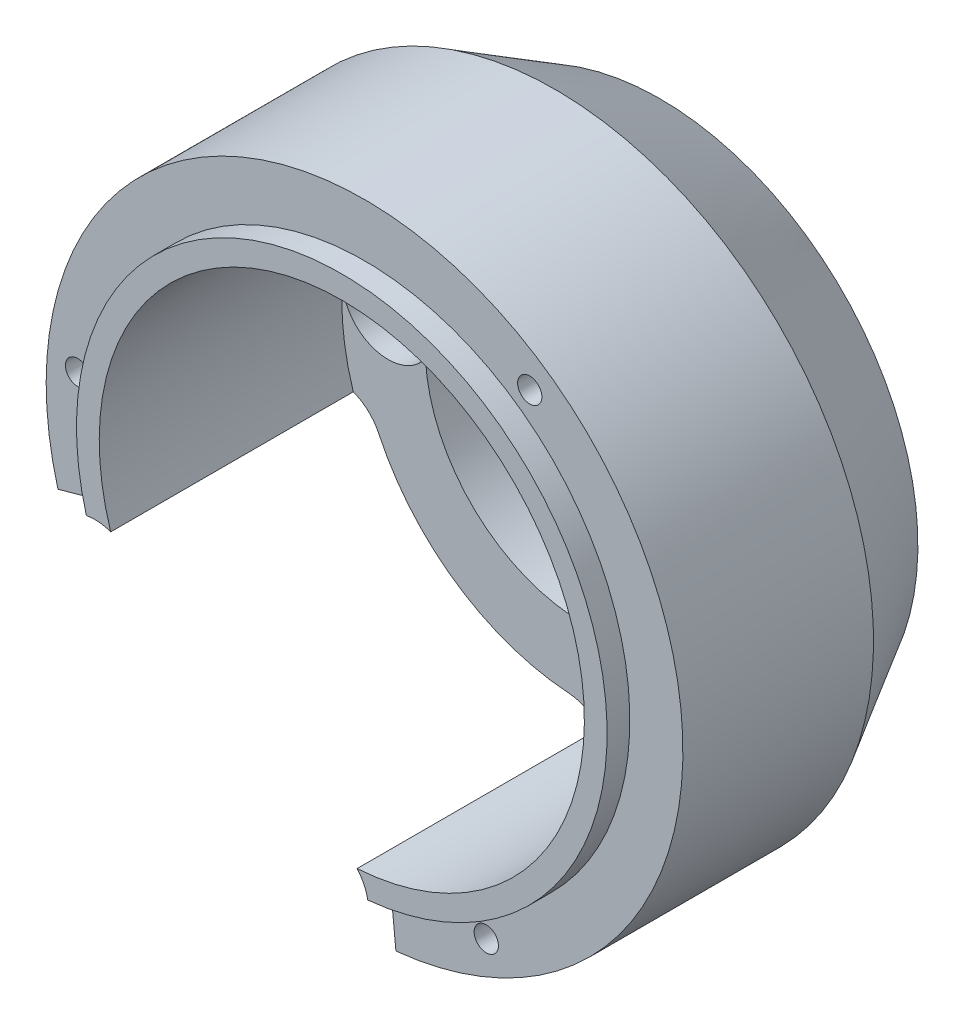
ISO-10303-21;
HEADER;
FILE_DESCRIPTION(('STEP AP214'),'2;1');
FILE_NAME('part.step','',(''),(''),'','','');
FILE_SCHEMA(('AUTOMOTIVE_DESIGN { 1 0 10303 214 1 1 1 1 }'));
ENDSEC;
DATA;
#1=APPLICATION_CONTEXT('core data for automotive mechanical design processes');
#2=APPLICATION_PROTOCOL_DEFINITION('international standard','automotive_design',2000,#1);
#3=PRODUCT_CONTEXT('',#1,'mechanical');
#4=PRODUCT('Part','Part','',(#3));
#5=PRODUCT_RELATED_PRODUCT_CATEGORY('part','',(#4));
#6=PRODUCT_DEFINITION_FORMATION('','',#4);
#7=PRODUCT_DEFINITION_CONTEXT('part definition',#1,'design');
#8=PRODUCT_DEFINITION('design','',#6,#7);
#9=PRODUCT_DEFINITION_SHAPE('','',#8);
#10=(LENGTH_UNIT() NAMED_UNIT(*) SI_UNIT(.MILLI.,.METRE.));
#11=(NAMED_UNIT(*) PLANE_ANGLE_UNIT() SI_UNIT($,.RADIAN.));
#12=(NAMED_UNIT(*) SI_UNIT($,.STERADIAN.) SOLID_ANGLE_UNIT());
#13=UNCERTAINTY_MEASURE_WITH_UNIT(LENGTH_MEASURE(1.E-05),#10,'distance_accuracy_value','');
#14=(GEOMETRIC_REPRESENTATION_CONTEXT(3) GLOBAL_UNCERTAINTY_ASSIGNED_CONTEXT((#13)) GLOBAL_UNIT_ASSIGNED_CONTEXT((#10,
#11,#12)) REPRESENTATION_CONTEXT('',''));
#15=CARTESIAN_POINT('',(0.,0.,0.));
#16=DIRECTION('',(0.,0.,1.));
#17=DIRECTION('',(1.,0.,0.));
#18=AXIS2_PLACEMENT_3D('',#15,#16,#17);
#19=CARTESIAN_POINT('',(85.81149290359,60.56189797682,86.5));
#20=DIRECTION('',(0.,0.,1.));
#21=DIRECTION('',(1.,0.,0.));
#22=AXIS2_PLACEMENT_3D('',#19,#20,#21);
#23=CYLINDRICAL_SURFACE('',#22,1.);
#24=CARTESIAN_POINT('',(85.81149290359,60.56189797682,82.5));
#25=DIRECTION('',(0.,0.,1.));
#26=DIRECTION('',(1.,0.,0.));
#27=AXIS2_PLACEMENT_3D('',#24,#25,#26);
#28=CIRCLE('',#27,1.);
#29=CARTESIAN_POINT('',(86.81149290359,60.56189797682,82.5));
#30=VERTEX_POINT('',#29);
#31=EDGE_CURVE('P0_E20',#30,#30,#28,.T.);
#32=ORIENTED_EDGE('',*,*,#31,.T.);
#33=EDGE_LOOP('',(#32));
#34=FACE_BOUND('',#33,.T.);
#35=CARTESIAN_POINT('',(85.81149290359,60.56189797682,86.5));
#36=DIRECTION('',(0.,0.,1.));
#37=DIRECTION('',(1.,0.,0.));
#38=AXIS2_PLACEMENT_3D('',#35,#36,#37);
#39=CIRCLE('',#38,1.);
#40=CARTESIAN_POINT('',(86.81149290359,60.56189797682,86.5));
#41=VERTEX_POINT('',#40);
#42=EDGE_CURVE('P0_E11',#41,#41,#39,.F.);
#43=ORIENTED_EDGE('',*,*,#42,.T.);
#44=EDGE_LOOP('',(#43));
#45=FACE_BOUND('',#44,.T.);
#46=ADVANCED_FACE('P0_F16',(#34,#45),#23,.T.);
#47=CARTESIAN_POINT('',(85.81149290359,60.56189797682,82.5));
#48=DIRECTION('',(0.,0.,1.));
#49=DIRECTION('',(1.,0.,0.));
#50=AXIS2_PLACEMENT_3D('',#47,#48,#49);
#51=PLANE('',#50);
#52=CARTESIAN_POINT('',(85.01149290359,60.56189797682,82.5));
#53=CARTESIAN_POINT('',(85.0116955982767,60.7147378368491,82.5));
#54=CARTESIAN_POINT('',(85.0676622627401,60.8563737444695,82.5));
#55=CARTESIAN_POINT('',(85.1283567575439,61.00997446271,82.5));
#56=CARTESIAN_POINT('',(85.2458074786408,61.1275834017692,82.5));
#57=CARTESIAN_POINT('',(85.3625135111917,61.244446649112,82.5));
#58=CARTESIAN_POINT('',(85.5170171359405,61.30572861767,82.5));
#59=CARTESIAN_POINT('',(85.6583749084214,61.3617964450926,82.5));
#60=CARTESIAN_POINT('',(85.81149290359,61.36189797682,82.5));
#61=CARTESIAN_POINT('',(85.9635646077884,61.3619988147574,82.5));
#62=CARTESIAN_POINT('',(86.1059686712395,61.30572861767,82.5));
#63=CARTESIAN_POINT('',(86.2595693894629,61.24503412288,82.5));
#64=CARTESIAN_POINT('',(86.3771783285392,61.1275834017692,82.5));
#65=CARTESIAN_POINT('',(86.4940415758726,61.0108773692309,82.5));
#66=CARTESIAN_POINT('',(86.55532354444,60.8563737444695,82.5));
#67=CARTESIAN_POINT('',(86.6112894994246,60.7152728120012,82.5));
#68=CARTESIAN_POINT('',(86.61149290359,60.56189797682,82.5));
#69=B_SPLINE_CURVE_WITH_KNOTS('',2,(#52,#53,#54,#55,#56,#57,#58,#59,#60,#61,#62,#63,#64,#65,#66,
#67,#68),.UNSPECIFIED.,.F.,.F.,(3,2,2,2,2,2,2,2,3),(0.,0.125,0.25,0.375,0.5,0.625,0.75,0.875,
1.),.UNSPECIFIED.);
#70=CARTESIAN_POINT('',(85.01149290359,60.56189797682,82.5));
#71=VERTEX_POINT('',#70);
#72=CARTESIAN_POINT('',(86.61149290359,60.56189797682,82.5));
#73=VERTEX_POINT('',#72);
#74=EDGE_CURVE('P0_E28',#71,#73,#69,.T.);
#75=ORIENTED_EDGE('',*,*,#74,.F.);
#76=CARTESIAN_POINT('',(86.61149290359,60.56189797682,82.5));
#77=CARTESIAN_POINT('',(86.6112902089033,60.4090581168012,82.5));
#78=CARTESIAN_POINT('',(86.55532354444,60.2674222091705,82.5));
#79=CARTESIAN_POINT('',(86.4946290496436,60.1138214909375,82.5));
#80=CARTESIAN_POINT('',(86.3771783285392,59.9962125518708,82.5));
#81=CARTESIAN_POINT('',(86.2604722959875,59.8793493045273,82.5));
#82=CARTESIAN_POINT('',(86.1059686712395,59.8180673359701,82.5));
#83=CARTESIAN_POINT('',(85.9646108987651,59.7619995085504,82.5));
#84=CARTESIAN_POINT('',(85.81149290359,59.76189797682,82.5));
#85=CARTESIAN_POINT('',(85.6594211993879,59.7617971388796,82.5));
#86=CARTESIAN_POINT('',(85.5170171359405,59.8180673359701,82.5));
#87=CARTESIAN_POINT('',(85.3634164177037,59.8787618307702,82.5));
#88=CARTESIAN_POINT('',(85.2458074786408,59.9962125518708,82.5));
#89=CARTESIAN_POINT('',(85.1289442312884,60.1129185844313,82.5));
#90=CARTESIAN_POINT('',(85.0676622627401,60.2674222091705,82.5));
#91=CARTESIAN_POINT('',(85.0116963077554,60.4085231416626,82.5));
#92=CARTESIAN_POINT('',(85.01149290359,60.56189797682,82.5));
#93=B_SPLINE_CURVE_WITH_KNOTS('',2,(#76,#77,#78,#79,#80,#81,#82,#83,#84,#85,#86,#87,#88,#89,#90,
#91,#92),.UNSPECIFIED.,.F.,.F.,(3,2,2,2,2,2,2,2,3),(0.,0.125,0.25,0.375,0.5,0.625,0.75,0.875,
1.),.UNSPECIFIED.);
#94=EDGE_CURVE('P0_E33',#73,#71,#93,.T.);
#95=ORIENTED_EDGE('',*,*,#94,.F.);
#96=EDGE_LOOP('',(#75,#95));
#97=FACE_BOUND('',#96,.T.);
#98=ORIENTED_EDGE('',*,*,#31,.F.);
#99=EDGE_LOOP('',(#98));
#100=FACE_BOUND('',#99,.T.);
#101=ADVANCED_FACE('P0_F17',(#97,#100),#51,.F.);
#102=OPEN_SHELL('',(#46,#101));
#103=SHELL_BASED_SURFACE_MODEL('P0_B1',(#102));
#104=CARTESIAN_POINT('',(64.83121485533,78.91477058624,70.));
#105=DIRECTION('',(0.,0.,-1.));
#106=DIRECTION('',(-1.,0.,0.));
#107=AXIS2_PLACEMENT_3D('',#104,#105,#106);
#108=PLANE('',#107);
#109=CARTESIAN_POINT('',(64.83121485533,78.91477058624,70.));
#110=DIRECTION('',(0.,0.,-1.));
#111=DIRECTION('',(-1.,0.,0.));
#112=AXIS2_PLACEMENT_3D('',#109,#110,#111);
#113=CIRCLE('',#112,1.6);
#114=CARTESIAN_POINT('',(63.23121485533,78.91477058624,70.));
#115=VERTEX_POINT('',#114);
#116=EDGE_CURVE('P1_E424',#115,#115,#113,.T.);
#117=ORIENTED_EDGE('',*,*,#116,.T.);
#118=EDGE_LOOP('',(#117));
#119=FACE_BOUND('',#118,.T.);
#120=CARTESIAN_POINT('',(77.78174593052,77.78174593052,70.));
#121=DIRECTION('',(0.,0.,1.));
#122=DIRECTION('',(1.,0.,0.));
#123=AXIS2_PLACEMENT_3D('',#120,#121,#122);
#124=CIRCLE('',#123,10.5);
#125=CARTESIAN_POINT('',(67.2975029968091,77.2067240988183,70.));
#126=VERTEX_POINT('',#125);
#127=CARTESIAN_POINT('',(67.5566336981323,80.1686015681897,70.));
#128=VERTEX_POINT('',#127);
#129=EDGE_CURVE('P1_E184',#126,#128,#124,.F.);
#130=ORIENTED_EDGE('',*,*,#129,.T.);
#131=CARTESIAN_POINT('',(64.83121485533,78.91477058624,70.));
#132=DIRECTION('',(0.,0.,-1.));
#133=DIRECTION('',(-1.,0.,0.));
#134=AXIS2_PLACEMENT_3D('',#131,#132,#133);
#135=CIRCLE('',#134,3.);
#136=EDGE_CURVE('P1_E171',#128,#126,#135,.F.);
#137=ORIENTED_EDGE('',*,*,#136,.T.);
#138=EDGE_LOOP('',(#130,#137));
#139=FACE_BOUND('',#138,.T.);
#140=ADVANCED_FACE('P1_F16',(#119,#139),#108,.F.);
#141=CARTESIAN_POINT('',(77.78174593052,77.78174593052,72.));
#142=DIRECTION('',(0.,0.,1.));
#143=DIRECTION('',(1.,0.,0.));
#144=AXIS2_PLACEMENT_3D('',#141,#142,#143);
#145=PLANE('',#144);
#146=CARTESIAN_POINT('',(77.78174593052,77.78174593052,72.));
#147=DIRECTION('',(0.,0.,1.));
#148=DIRECTION('',(1.,0.,0.));
#149=AXIS2_PLACEMENT_3D('',#146,#147,#148);
#150=CIRCLE('',#149,16.);
#151=CARTESIAN_POINT('',(86.9589689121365,90.8881786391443,72.));
#152=VERTEX_POINT('',#151);
#153=CARTESIAN_POINT('',(61.8426307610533,79.1762378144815,72.));
#154=VERTEX_POINT('',#153);
#155=EDGE_CURVE('P1_E440',#152,#154,#150,.T.);
#156=ORIENTED_EDGE('',*,*,#155,.T.);
#157=CARTESIAN_POINT('',(64.83121485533,78.91477058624,72.));
#158=DIRECTION('',(0.,0.,-1.));
#159=DIRECTION('',(-1.,0.,0.));
#160=AXIS2_PLACEMENT_3D('',#157,#158,#159);
#161=CIRCLE('',#160,3.);
#162=CARTESIAN_POINT('',(67.5566336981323,80.1686015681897,72.));
#163=VERTEX_POINT('',#162);
#164=EDGE_CURVE('P1_E156',#154,#163,#161,.T.);
#165=ORIENTED_EDGE('',*,*,#164,.T.);
#166=CARTESIAN_POINT('',(77.78174593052,77.78174593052,72.));
#167=DIRECTION('',(0.,0.,1.));
#168=DIRECTION('',(1.,0.,0.));
#169=AXIS2_PLACEMENT_3D('',#166,#167,#168);
#170=CIRCLE('',#169,10.5);
#171=CARTESIAN_POINT('',(82.5258838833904,87.1488775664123,72.));
#172=VERTEX_POINT('',#171);
#173=EDGE_CURVE('P1_E151',#163,#172,#170,.F.);
#174=ORIENTED_EDGE('',*,*,#173,.T.);
#175=CARTESIAN_POINT('',(85.23823960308,88.43072250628,72.));
#176=DIRECTION('',(0.,0.,-1.));
#177=DIRECTION('',(-1.,0.,0.));
#178=AXIS2_PLACEMENT_3D('',#175,#176,#177);
#179=CIRCLE('',#178,3.);
#180=EDGE_CURVE('P1_E19',#172,#152,#179,.T.);
#181=ORIENTED_EDGE('',*,*,#180,.T.);
#182=EDGE_LOOP('',(#156,#165,#174,#181));
#183=FACE_BOUND('',#182,.T.);
#184=ADVANCED_FACE('P1_F154',(#183),#145,.T.);
#185=CARTESIAN_POINT('',(85.23823960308,88.43072250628,72.));
#186=DIRECTION('',(0.,0.,-1.));
#187=DIRECTION('',(-1.,0.,0.));
#188=AXIS2_PLACEMENT_3D('',#185,#186,#187);
#189=CYLINDRICAL_SURFACE('',#188,3.);
#190=CARTESIAN_POINT('',(85.23823960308,88.43072250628,72.));
#191=DIRECTION('',(0.,0.,-1.));
#192=DIRECTION('',(-1.,0.,0.));
#193=AXIS2_PLACEMENT_3D('',#190,#191,#192);
#194=CIRCLE('',#193,3.);
#195=CARTESIAN_POINT('',(84.9613796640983,85.4435250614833,72.));
#196=VERTEX_POINT('',#195);
#197=EDGE_CURVE('P1_E169',#152,#196,#194,.T.);
#198=ORIENTED_EDGE('',*,*,#197,.F.);
#199=ORIENTED_EDGE('',*,*,#180,.F.);
#200=DIRECTION('',(0.,0.,1.));
#201=VECTOR('',#200,1.);
#202=CARTESIAN_POINT('',(82.525883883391,87.148877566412,65.95));
#203=LINE('',#202,#201);
#204=CARTESIAN_POINT('',(82.5258838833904,87.1488775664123,70.));
#205=VERTEX_POINT('',#204);
#206=EDGE_CURVE('P1_E161',#172,#205,#203,.F.);
#207=ORIENTED_EDGE('',*,*,#206,.T.);
#208=CARTESIAN_POINT('',(85.23823960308,88.43072250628,70.));
#209=DIRECTION('',(0.,0.,-1.));
#210=DIRECTION('',(-1.,0.,0.));
#211=AXIS2_PLACEMENT_3D('',#208,#209,#210);
#212=CIRCLE('',#211,3.);
#213=CARTESIAN_POINT('',(84.9613796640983,85.4435250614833,70.));
#214=VERTEX_POINT('',#213);
#215=EDGE_CURVE('P1_E411',#205,#214,#212,.T.);
#216=ORIENTED_EDGE('',*,*,#215,.T.);
#217=DIRECTION('',(0.,0.,1.));
#218=VECTOR('',#217,1.);
#219=CARTESIAN_POINT('',(84.9613796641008,85.4435250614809,65.95));
#220=LINE('',#219,#218);
#221=EDGE_CURVE('P1_E178',#214,#196,#220,.T.);
#222=ORIENTED_EDGE('',*,*,#221,.T.);
#223=EDGE_LOOP('',(#198,#199,#207,#216,#222));
#224=FACE_BOUND('',#223,.T.);
#225=ADVANCED_FACE('P1_F165',(#224),#189,.F.);
#226=CARTESIAN_POINT('',(64.83121485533,78.91477058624,72.));
#227=DIRECTION('',(0.,0.,-1.));
#228=DIRECTION('',(-1.,0.,0.));
#229=AXIS2_PLACEMENT_3D('',#226,#227,#228);
#230=CYLINDRICAL_SURFACE('',#229,3.);
#231=ORIENTED_EDGE('',*,*,#164,.F.);
#232=CARTESIAN_POINT('',(64.83121485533,78.91477058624,72.));
#233=DIRECTION('',(0.,0.,-1.));
#234=DIRECTION('',(-1.,0.,0.));
#235=AXIS2_PLACEMENT_3D('',#232,#233,#234);
#236=CIRCLE('',#235,3.);
#237=CARTESIAN_POINT('',(67.2975029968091,77.2067240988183,72.));
#238=VERTEX_POINT('',#237);
#239=EDGE_CURVE('P1_E449',#238,#154,#236,.T.);
#240=ORIENTED_EDGE('',*,*,#239,.F.);
#241=DIRECTION('',(0.,0.,1.));
#242=VECTOR('',#241,1.);
#243=CARTESIAN_POINT('',(67.297502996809,77.20672409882,65.95));
#244=LINE('',#243,#242);
#245=EDGE_CURVE('P1_E404',#238,#126,#244,.F.);
#246=ORIENTED_EDGE('',*,*,#245,.T.);
#247=ORIENTED_EDGE('',*,*,#136,.F.);
#248=DIRECTION('',(0.,0.,1.));
#249=VECTOR('',#248,1.);
#250=CARTESIAN_POINT('',(67.5566336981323,80.1686015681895,65.95));
#251=LINE('',#250,#249);
#252=EDGE_CURVE('P1_E162',#128,#163,#251,.T.);
#253=ORIENTED_EDGE('',*,*,#252,.T.);
#254=EDGE_LOOP('',(#231,#240,#246,#247,#253));
#255=FACE_BOUND('',#254,.T.);
#256=ADVANCED_FACE('P1_F332',(#255),#230,.F.);
#257=CARTESIAN_POINT('',(83.27578333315,65.99974469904,70.));
#258=DIRECTION('',(0.,0.,-1.));
#259=DIRECTION('',(-1.,0.,0.));
#260=AXIS2_PLACEMENT_3D('',#257,#258,#259);
#261=PLANE('',#260);
#262=CARTESIAN_POINT('',(83.27578333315,65.99974469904,70.));
#263=DIRECTION('',(0.,0.,-1.));
#264=DIRECTION('',(-1.,0.,0.));
#265=AXIS2_PLACEMENT_3D('',#262,#263,#264);
#266=CIRCLE('',#265,1.6);
#267=CARTESIAN_POINT('',(81.67578333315,65.99974469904,70.));
#268=VERTEX_POINT('',#267);
#269=EDGE_CURVE('P1_E427',#268,#268,#266,.T.);
#270=ORIENTED_EDGE('',*,*,#269,.T.);
#271=EDGE_LOOP('',(#270));
#272=FACE_BOUND('',#271,.T.);
#273=CARTESIAN_POINT('',(77.78174593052,77.78174593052,70.));
#274=DIRECTION('',(0.,0.,1.));
#275=DIRECTION('',(1.,0.,0.));
#276=AXIS2_PLACEMENT_3D('',#273,#274,#275);
#277=CIRCLE('',#276,10.5);
#278=CARTESIAN_POINT('',(83.5218509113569,68.9896361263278,70.));
#279=VERTEX_POINT('',#278);
#280=CARTESIAN_POINT('',(80.8272244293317,67.7331111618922,70.));
#281=VERTEX_POINT('',#280);
#282=EDGE_CURVE('P1_E403',#279,#281,#277,.F.);
#283=ORIENTED_EDGE('',*,*,#282,.T.);
#284=CARTESIAN_POINT('',(83.27578333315,65.99974469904,70.));
#285=DIRECTION('',(0.,0.,-1.));
#286=DIRECTION('',(-1.,0.,0.));
#287=AXIS2_PLACEMENT_3D('',#284,#285,#286);
#288=CIRCLE('',#287,3.);
#289=EDGE_CURVE('P1_E416',#281,#279,#288,.F.);
#290=ORIENTED_EDGE('',*,*,#289,.T.);
#291=EDGE_LOOP('',(#283,#290));
#292=FACE_BOUND('',#291,.T.);
#293=ADVANCED_FACE('P1_F328',(#272,#292),#261,.F.);
#294=CARTESIAN_POINT('',(77.78174593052,77.78174593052,72.));
#295=DIRECTION('',(0.,0.,1.));
#296=DIRECTION('',(1.,0.,0.));
#297=AXIS2_PLACEMENT_3D('',#294,#295,#296);
#298=PLANE('',#297);
#299=CARTESIAN_POINT('',(77.78174593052,77.78174593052,72.));
#300=DIRECTION('',(0.,0.,1.));
#301=DIRECTION('',(1.,0.,0.));
#302=AXIS2_PLACEMENT_3D('',#299,#300,#301);
#303=CIRCLE('',#302,10.5);
#304=CARTESIAN_POINT('',(83.5218509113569,68.9896361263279,72.));
#305=VERTEX_POINT('',#304);
#306=EDGE_CURVE('P1_E400',#196,#305,#303,.F.);
#307=ORIENTED_EDGE('',*,*,#306,.T.);
#308=CARTESIAN_POINT('',(83.27578333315,65.99974469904,72.));
#309=DIRECTION('',(0.,0.,-1.));
#310=DIRECTION('',(-1.,0.,0.));
#311=AXIS2_PLACEMENT_3D('',#308,#309,#310);
#312=CIRCLE('',#311,3.);
#313=CARTESIAN_POINT('',(84.5436381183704,63.2808213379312,72.));
#314=VERTEX_POINT('',#313);
#315=EDGE_CURVE('P1_E418',#305,#314,#312,.T.);
#316=ORIENTED_EDGE('',*,*,#315,.T.);
#317=CARTESIAN_POINT('',(77.78174593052,77.78174593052,72.));
#318=DIRECTION('',(0.,0.,1.));
#319=DIRECTION('',(1.,0.,0.));
#320=AXIS2_PLACEMENT_3D('',#317,#318,#319);
#321=CIRCLE('',#320,16.);
#322=EDGE_CURVE('P1_E414',#314,#152,#321,.T.);
#323=ORIENTED_EDGE('',*,*,#322,.T.);
#324=ORIENTED_EDGE('',*,*,#197,.T.);
#325=EDGE_LOOP('',(#307,#316,#323,#324));
#326=FACE_BOUND('',#325,.T.);
#327=ADVANCED_FACE('P1_F324',(#326),#298,.T.);
#328=CARTESIAN_POINT('',(83.27578333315,65.99974469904,72.));
#329=DIRECTION('',(0.,0.,-1.));
#330=DIRECTION('',(-1.,0.,0.));
#331=AXIS2_PLACEMENT_3D('',#328,#329,#330);
#332=CYLINDRICAL_SURFACE('',#331,3.);
#333=CARTESIAN_POINT('',(83.27578333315,65.99974469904,72.));
#334=DIRECTION('',(0.,0.,-1.));
#335=DIRECTION('',(-1.,0.,0.));
#336=AXIS2_PLACEMENT_3D('',#333,#334,#335);
#337=CIRCLE('',#336,3.);
#338=CARTESIAN_POINT('',(80.8272244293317,67.7331111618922,72.));
#339=VERTEX_POINT('',#338);
#340=EDGE_CURVE('P1_E446',#314,#339,#337,.T.);
#341=ORIENTED_EDGE('',*,*,#340,.F.);
#342=ORIENTED_EDGE('',*,*,#315,.F.);
#343=DIRECTION('',(0.,0.,1.));
#344=VECTOR('',#343,1.);
#345=CARTESIAN_POINT('',(83.52185091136,68.9896361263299,65.95));
#346=LINE('',#345,#344);
#347=EDGE_CURVE('P1_E397',#305,#279,#346,.F.);
#348=ORIENTED_EDGE('',*,*,#347,.T.);
#349=ORIENTED_EDGE('',*,*,#289,.F.);
#350=DIRECTION('',(0.,0.,1.));
#351=VECTOR('',#350,1.);
#352=CARTESIAN_POINT('',(80.8272244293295,67.7331111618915,65.95));
#353=LINE('',#352,#351);
#354=EDGE_CURVE('P1_E401',#281,#339,#353,.T.);
#355=ORIENTED_EDGE('',*,*,#354,.T.);
#356=EDGE_LOOP('',(#341,#342,#348,#349,#355));
#357=FACE_BOUND('',#356,.T.);
#358=ADVANCED_FACE('P1_F320',(#357),#332,.F.);
#359=CARTESIAN_POINT('',(85.23823960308,88.43072250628,70.));
#360=DIRECTION('',(0.,0.,-1.));
#361=DIRECTION('',(-1.,0.,0.));
#362=AXIS2_PLACEMENT_3D('',#359,#360,#361);
#363=PLANE('',#362);
#364=CARTESIAN_POINT('',(85.23823960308,88.43072250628,70.));
#365=DIRECTION('',(0.,0.,-1.));
#366=DIRECTION('',(-1.,0.,0.));
#367=AXIS2_PLACEMENT_3D('',#364,#365,#366);
#368=CIRCLE('',#367,1.6);
#369=CARTESIAN_POINT('',(83.63823960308,88.43072250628,70.));
#370=VERTEX_POINT('',#369);
#371=EDGE_CURVE('P1_E263',#370,#370,#368,.T.);
#372=ORIENTED_EDGE('',*,*,#371,.T.);
#373=EDGE_LOOP('',(#372));
#374=FACE_BOUND('',#373,.T.);
#375=CARTESIAN_POINT('',(77.78174593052,77.78174593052,70.));
#376=DIRECTION('',(0.,0.,1.));
#377=DIRECTION('',(1.,0.,0.));
#378=AXIS2_PLACEMENT_3D('',#375,#376,#377);
#379=CIRCLE('',#378,10.5);
#380=EDGE_CURVE('P1_E176',#205,#214,#379,.F.);
#381=ORIENTED_EDGE('',*,*,#380,.T.);
#382=ORIENTED_EDGE('',*,*,#215,.F.);
#383=EDGE_LOOP('',(#381,#382));
#384=FACE_BOUND('',#383,.T.);
#385=ADVANCED_FACE('P1_F316',(#374,#384),#363,.F.);
#386=CARTESIAN_POINT('',(77.78174593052,77.78174593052,88.));
#387=DIRECTION('',(0.,0.,1.));
#388=DIRECTION('',(1.,0.,0.));
#389=AXIS2_PLACEMENT_3D('',#386,#387,#388);
#390=PLANE('',#389);
#391=CARTESIAN_POINT('',(77.78174593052,77.78174593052,88.));
#392=DIRECTION('',(0.,0.,1.));
#393=DIRECTION('',(1.,0.,0.));
#394=AXIS2_PLACEMENT_3D('',#391,#392,#393);
#395=CIRCLE('',#394,17.5);
#396=CARTESIAN_POINT('',(60.9337304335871,73.0494765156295,88.));
#397=VERTEX_POINT('',#396);
#398=CARTESIAN_POINT('',(79.4960177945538,60.3659119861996,88.));
#399=VERTEX_POINT('',#398);
#400=EDGE_CURVE('P1_E375',#397,#399,#395,.F.);
#401=ORIENTED_EDGE('',*,*,#400,.F.);
#402=CARTESIAN_POINT('',(61.50146894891,70.1036874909,88.));
#403=DIRECTION('',(0.,0.,-1.));
#404=DIRECTION('',(-1.,0.,0.));
#405=AXIS2_PLACEMENT_3D('',#402,#403,#404);
#406=CIRCLE('',#405,3.);
#407=CARTESIAN_POINT('',(62.5386967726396,72.9186756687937,88.));
#408=VERTEX_POINT('',#407);
#409=EDGE_CURVE('P1_E396',#397,#408,#406,.T.);
#410=ORIENTED_EDGE('',*,*,#409,.T.);
#411=CARTESIAN_POINT('',(77.78174593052,77.78174593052,88.));
#412=DIRECTION('',(0.,0.,1.));
#413=DIRECTION('',(1.,0.,0.));
#414=AXIS2_PLACEMENT_3D('',#411,#412,#413);
#415=CIRCLE('',#414,16.);
#416=CARTESIAN_POINT('',(78.7908778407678,61.8136009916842,88.));
#417=VERTEX_POINT('',#416);
#418=EDGE_CURVE('P1_E435',#408,#417,#415,.F.);
#419=ORIENTED_EDGE('',*,*,#418,.T.);
#420=CARTESIAN_POINT('',(76.5453204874,59.82426135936,88.));
#421=DIRECTION('',(0.,0.,-1.));
#422=DIRECTION('',(-1.,0.,0.));
#423=AXIS2_PLACEMENT_3D('',#420,#421,#422);
#424=CIRCLE('',#423,3.);
#425=EDGE_CURVE('P1_E452',#417,#399,#424,.T.);
#426=ORIENTED_EDGE('',*,*,#425,.T.);
#427=EDGE_LOOP('',(#401,#410,#419,#426));
#428=FACE_BOUND('',#427,.T.);
#429=ADVANCED_FACE('P1_F312',(#428),#390,.T.);
#430=CARTESIAN_POINT('',(88.67969822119,93.34563477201,81.4999999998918));
#431=DIRECTION('',(0.,0.,1.));
#432=DIRECTION('',(1.,0.,0.));
#433=AXIS2_PLACEMENT_3D('',#430,#431,#432);
#434=CONICAL_SURFACE('',#433,0.799999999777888,1.04719755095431);
#435=CARTESIAN_POINT('',(88.67969822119,93.34563477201,81.5));
#436=DIRECTION('',(0.,0.,-1.));
#437=DIRECTION('',(-1.,0.,0.));
#438=AXIS2_PLACEMENT_3D('',#435,#436,#437);
#439=CIRCLE('',#438,0.8);
#440=CARTESIAN_POINT('',(87.87969822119,93.34563477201,81.5));
#441=VERTEX_POINT('',#440);
#442=EDGE_CURVE('P1_E390',#441,#441,#439,.F.);
#443=ORIENTED_EDGE('',*,*,#442,.T.);
#444=EDGE_LOOP('',(#443));
#445=FACE_BOUND('',#444,.T.);
#446=CARTESIAN_POINT('',(88.67969822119,93.34563477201,81.0381197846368));
#447=VERTEX_POINT('',#446);
#448=VERTEX_LOOP('',#447);
#449=FACE_BOUND('',#448,.T.);
#450=ADVANCED_FACE('P1_F308',(#445,#449),#434,.F.);
#451=CARTESIAN_POINT('',(58.85404666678,79.43770504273,81.5000000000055));
#452=DIRECTION('',(0.,0.,1.));
#453=DIRECTION('',(1.,0.,0.));
#454=AXIS2_PLACEMENT_3D('',#451,#452,#453);
#455=CONICAL_SURFACE('',#454,0.799999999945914,1.04719755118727);
#456=CARTESIAN_POINT('',(58.85404666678,79.43770504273,81.5));
#457=DIRECTION('',(0.,0.,-1.));
#458=DIRECTION('',(-1.,0.,0.));
#459=AXIS2_PLACEMENT_3D('',#456,#457,#458);
#460=CIRCLE('',#459,0.8);
#461=CARTESIAN_POINT('',(58.05404666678,79.43770504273,81.5));
#462=VERTEX_POINT('',#461);
#463=EDGE_CURVE('P1_E387',#462,#462,#460,.F.);
#464=ORIENTED_EDGE('',*,*,#463,.T.);
#465=EDGE_LOOP('',(#464));
#466=FACE_BOUND('',#465,.T.);
#467=CARTESIAN_POINT('',(58.8540466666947,79.4377050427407,81.0381197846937));
#468=VERTEX_POINT('',#467);
#469=VERTEX_LOOP('',#468);
#470=FACE_BOUND('',#469,.T.);
#471=ADVANCED_FACE('P1_F304',(#466,#470),#455,.F.);
#472=CARTESIAN_POINT('',(85.81149290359,60.56189797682,81.4999999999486));
#473=DIRECTION('',(0.,0.,1.));
#474=DIRECTION('',(1.,0.,0.));
#475=AXIS2_PLACEMENT_3D('',#472,#473,#474);
#476=CONICAL_SURFACE('',#475,0.800000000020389,1.04719755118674);
#477=CARTESIAN_POINT('',(85.81149290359,60.56189797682,81.5));
#478=DIRECTION('',(0.,0.,-1.));
#479=DIRECTION('',(-1.,0.,0.));
#480=AXIS2_PLACEMENT_3D('',#477,#478,#479);
#481=CIRCLE('',#480,0.8);
#482=CARTESIAN_POINT('',(85.01149290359,60.56189797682,81.5));
#483=VERTEX_POINT('',#482);
#484=EDGE_CURVE('P1_E380',#483,#483,#481,.F.);
#485=ORIENTED_EDGE('',*,*,#484,.T.);
#486=EDGE_LOOP('',(#485));
#487=FACE_BOUND('',#486,.T.);
#488=CARTESIAN_POINT('',(85.81149290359,60.56189797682,81.03811978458));
#489=VERTEX_POINT('',#488);
#490=VERTEX_LOOP('',#489);
#491=FACE_BOUND('',#490,.T.);
#492=ADVANCED_FACE('P1_F300',(#487,#491),#476,.F.);
#493=CARTESIAN_POINT('',(77.78174593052,77.78174593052,72.));
#494=DIRECTION('',(0.,0.,1.));
#495=DIRECTION('',(1.,0.,0.));
#496=AXIS2_PLACEMENT_3D('',#493,#494,#495);
#497=PLANE('',#496);
#498=CARTESIAN_POINT('',(77.78174593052,77.78174593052,72.));
#499=DIRECTION('',(0.,0.,1.));
#500=DIRECTION('',(1.,0.,0.));
#501=AXIS2_PLACEMENT_3D('',#498,#499,#500);
#502=CIRCLE('',#501,16.);
#503=CARTESIAN_POINT('',(78.7908778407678,61.8136009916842,72.));
#504=VERTEX_POINT('',#503);
#505=EDGE_CURVE('P1_E443',#504,#314,#502,.T.);
#506=ORIENTED_EDGE('',*,*,#505,.T.);
#507=ORIENTED_EDGE('',*,*,#340,.T.);
#508=CARTESIAN_POINT('',(77.78174593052,77.78174593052,72.));
#509=DIRECTION('',(0.,0.,1.));
#510=DIRECTION('',(1.,0.,0.));
#511=AXIS2_PLACEMENT_3D('',#508,#509,#510);
#512=CIRCLE('',#511,10.5);
#513=EDGE_CURVE('P1_E402',#339,#238,#512,.F.);
#514=ORIENTED_EDGE('',*,*,#513,.T.);
#515=ORIENTED_EDGE('',*,*,#239,.T.);
#516=CARTESIAN_POINT('',(77.78174593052,77.78174593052,72.));
#517=DIRECTION('',(0.,0.,1.));
#518=DIRECTION('',(1.,0.,0.));
#519=AXIS2_PLACEMENT_3D('',#516,#517,#518);
#520=CIRCLE('',#519,16.);
#521=CARTESIAN_POINT('',(62.5386967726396,72.9186756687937,72.));
#522=VERTEX_POINT('',#521);
#523=EDGE_CURVE('P1_E438',#154,#522,#520,.T.);
#524=ORIENTED_EDGE('',*,*,#523,.T.);
#525=CARTESIAN_POINT('',(61.50146894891,70.1036874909,72.));
#526=DIRECTION('',(0.,0.,-1.));
#527=DIRECTION('',(-1.,0.,0.));
#528=AXIS2_PLACEMENT_3D('',#525,#526,#527);
#529=CIRCLE('',#528,3.);
#530=CARTESIAN_POINT('',(64.2148484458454,71.3833638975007,72.));
#531=VERTEX_POINT('',#530);
#532=EDGE_CURVE('P1_E382',#522,#531,#529,.T.);
#533=ORIENTED_EDGE('',*,*,#532,.T.);
#534=CARTESIAN_POINT('',(77.78174593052,77.78174593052,72.));
#535=DIRECTION('',(0.,0.,-1.));
#536=DIRECTION('',(-1.,0.,0.));
#537=AXIS2_PLACEMENT_3D('',#534,#535,#536);
#538=CIRCLE('',#537,15.);
#539=CARTESIAN_POINT('',(76.7513913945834,62.8171754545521,72.));
#540=VERTEX_POINT('',#539);
#541=EDGE_CURVE('P1_E432',#540,#531,#538,.T.);
#542=ORIENTED_EDGE('',*,*,#541,.F.);
#543=CARTESIAN_POINT('',(76.5453204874,59.82426135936,72.));
#544=DIRECTION('',(0.,0.,-1.));
#545=DIRECTION('',(-1.,0.,0.));
#546=AXIS2_PLACEMENT_3D('',#543,#544,#545);
#547=CIRCLE('',#546,3.);
#548=EDGE_CURVE('P1_E238',#540,#504,#547,.T.);
#549=ORIENTED_EDGE('',*,*,#548,.T.);
#550=EDGE_LOOP('',(#506,#507,#514,#515,#524,#533,#542,#549));
#551=FACE_BOUND('',#550,.T.);
#552=ADVANCED_FACE('P1_F296',(#551),#497,.T.);
#553=CARTESIAN_POINT('',(77.78174593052,77.78174593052,65.95));
#554=DIRECTION('',(0.,0.,1.));
#555=DIRECTION('',(1.,0.,0.));
#556=AXIS2_PLACEMENT_3D('',#553,#554,#555);
#557=CYLINDRICAL_SURFACE('',#556,16.);
#558=ORIENTED_EDGE('',*,*,#418,.F.);
#559=DIRECTION('',(0.,0.,-1.));
#560=VECTOR('',#559,1.);
#561=CARTESIAN_POINT('',(62.5386967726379,72.9186756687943,0.));
#562=LINE('',#561,#560);
#563=EDGE_CURVE('P1_E393',#408,#522,#562,.T.);
#564=ORIENTED_EDGE('',*,*,#563,.T.);
#565=ORIENTED_EDGE('',*,*,#523,.F.);
#566=ORIENTED_EDGE('',*,*,#155,.F.);
#567=ORIENTED_EDGE('',*,*,#322,.F.);
#568=ORIENTED_EDGE('',*,*,#505,.F.);
#569=DIRECTION('',(0.,0.,-1.));
#570=VECTOR('',#569,1.);
#571=CARTESIAN_POINT('',(78.7908778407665,61.8136009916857,0.));
#572=LINE('',#571,#570);
#573=EDGE_CURVE('P1_E371',#504,#417,#572,.F.);
#574=ORIENTED_EDGE('',*,*,#573,.T.);
#575=EDGE_LOOP('',(#558,#564,#565,#566,#567,#568,#574));
#576=FACE_BOUND('',#575,.T.);
#577=ADVANCED_FACE('P1_F292',(#576),#557,.F.);
#578=CARTESIAN_POINT('',(77.78174593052,77.78174593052,0.));
#579=DIRECTION('',(0.,0.,-1.));
#580=DIRECTION('',(-1.,0.,0.));
#581=AXIS2_PLACEMENT_3D('',#578,#579,#580);
#582=CYLINDRICAL_SURFACE('',#581,15.);
#583=DIRECTION('',(0.,0.,-1.));
#584=VECTOR('',#583,1.);
#585=CARTESIAN_POINT('',(64.2148484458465,71.3833638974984,0.));
#586=LINE('',#585,#584);
#587=CARTESIAN_POINT('',(64.2148484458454,71.3833638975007,67.));
#588=VERTEX_POINT('',#587);
#589=EDGE_CURVE('P1_E376',#531,#588,#586,.T.);
#590=ORIENTED_EDGE('',*,*,#589,.T.);
#591=CARTESIAN_POINT('',(77.78174593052,77.78174593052,67.));
#592=DIRECTION('',(0.,0.,-1.));
#593=DIRECTION('',(-1.,0.,0.));
#594=AXIS2_PLACEMENT_3D('',#591,#592,#593);
#595=CIRCLE('',#594,15.);
#596=CARTESIAN_POINT('',(76.7513913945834,62.8171754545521,67.));
#597=VERTEX_POINT('',#596);
#598=EDGE_CURVE('P1_E225',#588,#597,#595,.F.);
#599=ORIENTED_EDGE('',*,*,#598,.T.);
#600=DIRECTION('',(0.,0.,-1.));
#601=VECTOR('',#600,1.);
#602=CARTESIAN_POINT('',(76.7513913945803,62.8171754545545,0.));
#603=LINE('',#602,#601);
#604=EDGE_CURVE('P1_E377',#597,#540,#603,.F.);
#605=ORIENTED_EDGE('',*,*,#604,.T.);
#606=ORIENTED_EDGE('',*,*,#541,.T.);
#607=EDGE_LOOP('',(#590,#599,#605,#606));
#608=FACE_BOUND('',#607,.T.);
#609=ADVANCED_FACE('P1_F288',(#608),#582,.T.);
#610=CARTESIAN_POINT('',(83.27578333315,65.99974469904,72.25));
#611=DIRECTION('',(0.,0.,-1.));
#612=DIRECTION('',(-1.,0.,0.));
#613=AXIS2_PLACEMENT_3D('',#610,#611,#612);
#614=CYLINDRICAL_SURFACE('',#613,1.6);
#615=CARTESIAN_POINT('',(83.27578333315,65.99974469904,67.));
#616=DIRECTION('',(0.,0.,-1.));
#617=DIRECTION('',(-1.,0.,0.));
#618=AXIS2_PLACEMENT_3D('',#615,#616,#617);
#619=CIRCLE('',#618,1.6);
#620=CARTESIAN_POINT('',(81.67578333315,65.99974469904,67.));
#621=VERTEX_POINT('',#620);
#622=EDGE_CURVE('P1_E219',#621,#621,#619,.T.);
#623=ORIENTED_EDGE('',*,*,#622,.T.);
#624=EDGE_LOOP('',(#623));
#625=FACE_BOUND('',#624,.T.);
#626=ORIENTED_EDGE('',*,*,#269,.F.);
#627=EDGE_LOOP('',(#626));
#628=FACE_BOUND('',#627,.T.);
#629=ADVANCED_FACE('P1_F284',(#625,#628),#614,.F.);
#630=CARTESIAN_POINT('',(64.83121485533,78.91477058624,72.25));
#631=DIRECTION('',(0.,0.,-1.));
#632=DIRECTION('',(-1.,0.,0.));
#633=AXIS2_PLACEMENT_3D('',#630,#631,#632);
#634=CYLINDRICAL_SURFACE('',#633,1.6);
#635=CARTESIAN_POINT('',(64.83121485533,78.91477058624,67.));
#636=DIRECTION('',(0.,0.,-1.));
#637=DIRECTION('',(-1.,0.,0.));
#638=AXIS2_PLACEMENT_3D('',#635,#636,#637);
#639=CIRCLE('',#638,1.6);
#640=CARTESIAN_POINT('',(63.23121485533,78.91477058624,67.));
#641=VERTEX_POINT('',#640);
#642=EDGE_CURVE('P1_E216',#641,#641,#639,.T.);
#643=ORIENTED_EDGE('',*,*,#642,.T.);
#644=EDGE_LOOP('',(#643));
#645=FACE_BOUND('',#644,.T.);
#646=ORIENTED_EDGE('',*,*,#116,.F.);
#647=EDGE_LOOP('',(#646));
#648=FACE_BOUND('',#647,.T.);
#649=ADVANCED_FACE('P1_F280',(#645,#648),#634,.F.);
#650=CARTESIAN_POINT('',(77.78174593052,77.78174593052,65.95));
#651=DIRECTION('',(0.,0.,1.));
#652=DIRECTION('',(1.,0.,0.));
#653=AXIS2_PLACEMENT_3D('',#650,#651,#652);
#654=CYLINDRICAL_SURFACE('',#653,10.5);
#655=CARTESIAN_POINT('',(77.78174593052,77.78174593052,67.));
#656=DIRECTION('',(0.,0.,1.));
#657=DIRECTION('',(1.,0.,0.));
#658=AXIS2_PLACEMENT_3D('',#655,#656,#657);
#659=CIRCLE('',#658,10.5);
#660=CARTESIAN_POINT('',(88.28174593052,77.78174593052,67.));
#661=VERTEX_POINT('',#660);
#662=EDGE_CURVE('P1_E213',#661,#661,#659,.F.);
#663=ORIENTED_EDGE('',*,*,#662,.T.);
#664=EDGE_LOOP('',(#663));
#665=FACE_BOUND('',#664,.T.);
#666=ORIENTED_EDGE('',*,*,#306,.F.);
#667=ORIENTED_EDGE('',*,*,#221,.F.);
#668=ORIENTED_EDGE('',*,*,#380,.F.);
#669=ORIENTED_EDGE('',*,*,#206,.F.);
#670=ORIENTED_EDGE('',*,*,#173,.F.);
#671=ORIENTED_EDGE('',*,*,#252,.F.);
#672=ORIENTED_EDGE('',*,*,#129,.F.);
#673=ORIENTED_EDGE('',*,*,#245,.F.);
#674=ORIENTED_EDGE('',*,*,#513,.F.);
#675=ORIENTED_EDGE('',*,*,#354,.F.);
#676=ORIENTED_EDGE('',*,*,#282,.F.);
#677=ORIENTED_EDGE('',*,*,#347,.F.);
#678=EDGE_LOOP('',(#666,#667,#668,#669,#670,#671,#672,#673,#674,#675,#676,#677));
#679=FACE_BOUND('',#678,.T.);
#680=ADVANCED_FACE('P1_F173',(#665,#679),#654,.F.);
#681=CARTESIAN_POINT('',(85.23823960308,88.43072250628,72.25));
#682=DIRECTION('',(0.,0.,-1.));
#683=DIRECTION('',(-1.,0.,0.));
#684=AXIS2_PLACEMENT_3D('',#681,#682,#683);
#685=CYLINDRICAL_SURFACE('',#684,1.6);
#686=CARTESIAN_POINT('',(85.23823960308,88.43072250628,67.));
#687=DIRECTION('',(0.,0.,-1.));
#688=DIRECTION('',(-1.,0.,0.));
#689=AXIS2_PLACEMENT_3D('',#686,#687,#688);
#690=CIRCLE('',#689,1.6);
#691=CARTESIAN_POINT('',(83.63823960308,88.43072250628,67.));
#692=VERTEX_POINT('',#691);
#693=EDGE_CURVE('P1_E210',#692,#692,#690,.T.);
#694=ORIENTED_EDGE('',*,*,#693,.T.);
#695=EDGE_LOOP('',(#694));
#696=FACE_BOUND('',#695,.T.);
#697=ORIENTED_EDGE('',*,*,#371,.F.);
#698=EDGE_LOOP('',(#697));
#699=FACE_BOUND('',#698,.T.);
#700=ADVANCED_FACE('P1_F272',(#696,#699),#685,.F.);
#701=CARTESIAN_POINT('',(61.50146894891,70.1036874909,0.));
#702=DIRECTION('',(0.,0.,-1.));
#703=DIRECTION('',(-1.,0.,0.));
#704=AXIS2_PLACEMENT_3D('',#701,#702,#703);
#705=CYLINDRICAL_SURFACE('',#704,3.);
#706=ORIENTED_EDGE('',*,*,#532,.F.);
#707=ORIENTED_EDGE('',*,*,#563,.F.);
#708=ORIENTED_EDGE('',*,*,#409,.F.);
#709=DIRECTION('',(0.,0.,1.));
#710=VECTOR('',#709,1.);
#711=CARTESIAN_POINT('',(60.9337304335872,73.0494765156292,65.95));
#712=LINE('',#711,#710);
#713=CARTESIAN_POINT('',(60.9337304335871,73.0494765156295,86.5));
#714=VERTEX_POINT('',#713);
#715=EDGE_CURVE('P1_E372',#714,#397,#712,.T.);
#716=ORIENTED_EDGE('',*,*,#715,.F.);
#717=CARTESIAN_POINT('',(61.50146894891,70.1036874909,86.5));
#718=DIRECTION('',(0.,0.,-1.));
#719=DIRECTION('',(-1.,0.,0.));
#720=AXIS2_PLACEMENT_3D('',#717,#718,#719);
#721=CIRCLE('',#720,3.);
#722=CARTESIAN_POINT('',(60.6919209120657,72.9923951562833,86.5));
#723=VERTEX_POINT('',#722);
#724=EDGE_CURVE('P1_E262',#723,#714,#721,.T.);
#725=ORIENTED_EDGE('',*,*,#724,.F.);
#726=DIRECTION('',(0.,0.,1.));
#727=VECTOR('',#726,1.);
#728=CARTESIAN_POINT('',(60.6919209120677,72.9923951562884,0.));
#729=LINE('',#728,#727);
#730=CARTESIAN_POINT('',(60.6919209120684,72.9923951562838,68.2959885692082));
#731=VERTEX_POINT('',#730);
#732=EDGE_CURVE('P1_E209',#723,#731,#729,.F.);
#733=ORIENTED_EDGE('',*,*,#732,.T.);
#734=CARTESIAN_POINT('',(61.4382598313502,73.103021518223,67.0000000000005));
#735=CARTESIAN_POINT('',(61.3741345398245,73.1016630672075,67.107429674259));
#736=CARTESIAN_POINT('',(61.3104664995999,73.0982710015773,67.2151018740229));
#737=CARTESIAN_POINT('',(61.1841334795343,73.0875312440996,67.430689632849));
#738=CARTESIAN_POINT('',(61.1214675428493,73.0801875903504,67.5386048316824));
#739=CARTESIAN_POINT('',(60.9970969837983,73.0616531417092,67.7546555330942));
#740=CARTESIAN_POINT('',(60.9353923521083,73.0504623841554,67.8627910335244));
#741=CARTESIAN_POINT('',(60.8129235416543,73.0242734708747,68.0792811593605));
#742=CARTESIAN_POINT('',(60.752160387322,73.0092714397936,68.1876358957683));
#743=CARTESIAN_POINT('',(60.6919209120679,72.9923951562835,68.2959885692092));
#744=B_SPLINE_CURVE_WITH_KNOTS('',3,(#734,#735,#736,#737,#738,#739,#740,#741,#742,#743),
.UNSPECIFIED.,.F.,.F.,(4,2,2,2,4),(0.,0.375336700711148,0.750290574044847,1.1252408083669,
1.50057383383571),.UNSPECIFIED.);
#745=CARTESIAN_POINT('',(61.4382598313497,73.1030215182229,67.0000000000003));
#746=VERTEX_POINT('',#745);
#747=EDGE_CURVE('P1_E255',#746,#731,#744,.T.);
#748=ORIENTED_EDGE('',*,*,#747,.F.);
#749=CARTESIAN_POINT('',(61.50146894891,70.1036874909,67.));
#750=DIRECTION('',(0.,0.,-1.));
#751=DIRECTION('',(-1.,0.,0.));
#752=AXIS2_PLACEMENT_3D('',#749,#750,#751);
#753=CIRCLE('',#752,3.);
#754=EDGE_CURVE('P1_E227',#746,#588,#753,.T.);
#755=ORIENTED_EDGE('',*,*,#754,.T.);
#756=ORIENTED_EDGE('',*,*,#589,.F.);
#757=EDGE_LOOP('',(#706,#707,#708,#716,#725,#733,#748,#755,#756));
#758=FACE_BOUND('',#757,.T.);
#759=ADVANCED_FACE('P1_F266',(#758),#705,.F.);
#760=CARTESIAN_POINT('',(77.78174593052,77.78174593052,65.95));
#761=DIRECTION('',(0.,0.,1.));
#762=DIRECTION('',(1.,0.,0.));
#763=AXIS2_PLACEMENT_3D('',#760,#761,#762);
#764=CYLINDRICAL_SURFACE('',#763,17.5);
#765=DIRECTION('',(0.,0.,-1.));
#766=VECTOR('',#765,1.);
#767=CARTESIAN_POINT('',(79.4960177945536,60.3659119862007,0.));
#768=LINE('',#767,#766);
#769=CARTESIAN_POINT('',(79.4960177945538,60.3659119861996,86.5));
#770=VERTEX_POINT('',#769);
#771=EDGE_CURVE('P1_E237',#399,#770,#768,.T.);
#772=ORIENTED_EDGE('',*,*,#771,.T.);
#773=CARTESIAN_POINT('',(77.78174593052,77.78174593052,86.5));
#774=DIRECTION('',(0.,0.,1.));
#775=DIRECTION('',(1.,0.,0.));
#776=AXIS2_PLACEMENT_3D('',#773,#774,#775);
#777=CIRCLE('',#776,17.5);
#778=EDGE_CURVE('P1_E206',#714,#770,#777,.F.);
#779=ORIENTED_EDGE('',*,*,#778,.F.);
#780=ORIENTED_EDGE('',*,*,#715,.T.);
#781=ORIENTED_EDGE('',*,*,#400,.T.);
#782=EDGE_LOOP('',(#772,#779,#780,#781));
#783=FACE_BOUND('',#782,.T.);
#784=ADVANCED_FACE('P1_F271',(#783),#764,.T.);
#785=CARTESIAN_POINT('',(88.67969822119,93.34563477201,86.77309401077));
#786=DIRECTION('',(0.,0.,-1.));
#787=DIRECTION('',(-1.,0.,0.));
#788=AXIS2_PLACEMENT_3D('',#785,#786,#787);
#789=CYLINDRICAL_SURFACE('',#788,0.8);
#790=ORIENTED_EDGE('',*,*,#442,.F.);
#791=EDGE_LOOP('',(#790));
#792=FACE_BOUND('',#791,.T.);
#793=CARTESIAN_POINT('',(88.67969822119,93.34563477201,86.5));
#794=DIRECTION('',(0.,0.,-1.));
#795=DIRECTION('',(-1.,0.,0.));
#796=AXIS2_PLACEMENT_3D('',#793,#794,#795);
#797=CIRCLE('',#796,0.8);
#798=CARTESIAN_POINT('',(87.87969822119,93.34563477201,86.5));
#799=VERTEX_POINT('',#798);
#800=EDGE_CURVE('P1_E199',#799,#799,#797,.T.);
#801=ORIENTED_EDGE('',*,*,#800,.F.);
#802=EDGE_LOOP('',(#801));
#803=FACE_BOUND('',#802,.T.);
#804=ADVANCED_FACE('P1_F514',(#792,#803),#789,.F.);
#805=CARTESIAN_POINT('',(58.85404666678,79.43770504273,86.77309401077));
#806=DIRECTION('',(0.,0.,-1.));
#807=DIRECTION('',(-1.,0.,0.));
#808=AXIS2_PLACEMENT_3D('',#805,#806,#807);
#809=CYLINDRICAL_SURFACE('',#808,0.8);
#810=ORIENTED_EDGE('',*,*,#463,.F.);
#811=EDGE_LOOP('',(#810));
#812=FACE_BOUND('',#811,.T.);
#813=CARTESIAN_POINT('',(58.85404666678,79.43770504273,86.5));
#814=DIRECTION('',(0.,0.,-1.));
#815=DIRECTION('',(-1.,0.,0.));
#816=AXIS2_PLACEMENT_3D('',#813,#814,#815);
#817=CIRCLE('',#816,0.8);
#818=CARTESIAN_POINT('',(58.05404666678,79.43770504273,86.5));
#819=VERTEX_POINT('',#818);
#820=EDGE_CURVE('P1_E196',#819,#819,#817,.T.);
#821=ORIENTED_EDGE('',*,*,#820,.F.);
#822=EDGE_LOOP('',(#821));
#823=FACE_BOUND('',#822,.T.);
#824=ADVANCED_FACE('P1_F516',(#812,#823),#809,.F.);
#825=CARTESIAN_POINT('',(85.81149290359,60.56189797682,86.77309401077));
#826=DIRECTION('',(0.,0.,-1.));
#827=DIRECTION('',(-1.,0.,0.));
#828=AXIS2_PLACEMENT_3D('',#825,#826,#827);
#829=CYLINDRICAL_SURFACE('',#828,0.8);
#830=ORIENTED_EDGE('',*,*,#484,.F.);
#831=EDGE_LOOP('',(#830));
#832=FACE_BOUND('',#831,.T.);
#833=CARTESIAN_POINT('',(85.81149290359,60.56189797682,86.5));
#834=DIRECTION('',(0.,0.,-1.));
#835=DIRECTION('',(-1.,0.,0.));
#836=AXIS2_PLACEMENT_3D('',#833,#834,#835);
#837=CIRCLE('',#836,0.8);
#838=CARTESIAN_POINT('',(85.01149290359,60.56189797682,86.5));
#839=VERTEX_POINT('',#838);
#840=EDGE_CURVE('P1_E192',#839,#839,#837,.T.);
#841=ORIENTED_EDGE('',*,*,#840,.F.);
#842=EDGE_LOOP('',(#841));
#843=FACE_BOUND('',#842,.T.);
#844=ADVANCED_FACE('P1_F500',(#832,#843),#829,.F.);
#845=CARTESIAN_POINT('',(76.5453204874,59.82426135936,0.));
#846=DIRECTION('',(0.,0.,-1.));
#847=DIRECTION('',(-1.,0.,0.));
#848=AXIS2_PLACEMENT_3D('',#845,#846,#847);
#849=CYLINDRICAL_SURFACE('',#848,3.);
#850=DIRECTION('',(0.,0.,1.));
#851=VECTOR('',#850,1.);
#852=CARTESIAN_POINT('',(79.53071873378,60.11989172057,0.));
#853=LINE('',#852,#851);
#854=CARTESIAN_POINT('',(79.5307187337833,60.119891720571,68.295988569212));
#855=VERTEX_POINT('',#854);
#856=CARTESIAN_POINT('',(79.5307187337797,60.1198917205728,86.5));
#857=VERTEX_POINT('',#856);
#858=EDGE_CURVE('P1_E195',#855,#857,#853,.T.);
#859=ORIENTED_EDGE('',*,*,#858,.T.);
#860=CARTESIAN_POINT('',(76.5453204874,59.82426135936,86.5));
#861=DIRECTION('',(0.,0.,-1.));
#862=DIRECTION('',(-1.,0.,0.));
#863=AXIS2_PLACEMENT_3D('',#860,#861,#862);
#864=CIRCLE('',#863,3.);
#865=EDGE_CURVE('P1_E203',#770,#857,#864,.T.);
#866=ORIENTED_EDGE('',*,*,#865,.F.);
#867=ORIENTED_EDGE('',*,*,#771,.F.);
#868=ORIENTED_EDGE('',*,*,#425,.F.);
#869=ORIENTED_EDGE('',*,*,#573,.F.);
#870=ORIENTED_EDGE('',*,*,#548,.F.);
#871=ORIENTED_EDGE('',*,*,#604,.F.);
#872=CARTESIAN_POINT('',(76.5453204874,59.82426135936,67.));
#873=DIRECTION('',(0.,0.,-1.));
#874=DIRECTION('',(-1.,0.,0.));
#875=AXIS2_PLACEMENT_3D('',#872,#873,#874);
#876=CIRCLE('',#875,3.);
#877=CARTESIAN_POINT('',(79.362543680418,60.8554031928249,67.0000000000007));
#878=VERTEX_POINT('',#877);
#879=EDGE_CURVE('P1_E222',#597,#878,#876,.T.);
#880=ORIENTED_EDGE('',*,*,#879,.T.);
#881=CARTESIAN_POINT('',(79.5307187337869,60.119891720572,68.2959885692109));
#882=CARTESIAN_POINT('',(79.5245486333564,60.1821455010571,68.1876358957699));
#883=CARTESIAN_POINT('',(79.516442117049,60.2442060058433,68.0792811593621));
#884=CARTESIAN_POINT('',(79.4963322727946,60.3678185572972,67.8627910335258));
#885=CARTESIAN_POINT('',(79.4843329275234,60.429371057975,67.7546555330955));
#886=CARTESIAN_POINT('',(79.4564008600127,60.551973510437,67.5386048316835));
#887=CARTESIAN_POINT('',(79.4404680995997,60.613023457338,67.4306896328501));
#888=CARTESIAN_POINT('',(79.4045611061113,60.734621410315,67.2151018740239));
#889=CARTESIAN_POINT('',(79.3845827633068,60.7951688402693,67.1074296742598));
#890=CARTESIAN_POINT('',(79.3625436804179,60.8554031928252,67.0000000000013));
#891=B_SPLINE_CURVE_WITH_KNOTS('',3,(#881,#882,#883,#884,#885,#886,#887,#888,#889,#890),
.UNSPECIFIED.,.F.,.F.,(4,2,2,2,4),(0.,0.375333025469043,0.750283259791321,1.12523713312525,
1.50057383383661),.UNSPECIFIED.);
#892=EDGE_CURVE('P1_E230',#855,#878,#891,.T.);
#893=ORIENTED_EDGE('',*,*,#892,.F.);
#894=EDGE_LOOP('',(#859,#866,#867,#868,#869,#870,#871,#880,#893));
#895=FACE_BOUND('',#894,.T.);
#896=ADVANCED_FACE('P1_F240',(#895),#849,.F.);
#897=CARTESIAN_POINT('',(77.78174593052,77.78174593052,67.));
#898=DIRECTION('',(0.,0.,1.));
#899=DIRECTION('',(1.,0.,0.));
#900=AXIS2_PLACEMENT_3D('',#897,#898,#899);
#901=PLANE('',#900);
#902=ORIENTED_EDGE('',*,*,#693,.F.);
#903=EDGE_LOOP('',(#902));
#904=FACE_BOUND('',#903,.T.);
#905=ORIENTED_EDGE('',*,*,#662,.F.);
#906=EDGE_LOOP('',(#905));
#907=FACE_BOUND('',#906,.T.);
#908=ORIENTED_EDGE('',*,*,#642,.F.);
#909=EDGE_LOOP('',(#908));
#910=FACE_BOUND('',#909,.T.);
#911=ORIENTED_EDGE('',*,*,#622,.F.);
#912=EDGE_LOOP('',(#911));
#913=FACE_BOUND('',#912,.T.);
#914=ORIENTED_EDGE('',*,*,#879,.F.);
#915=ORIENTED_EDGE('',*,*,#598,.F.);
#916=ORIENTED_EDGE('',*,*,#754,.F.);
#917=CARTESIAN_POINT('',(77.78174593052,77.78174593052,67.0000000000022));
#918=DIRECTION('',(0.,0.,1.));
#919=DIRECTION('',(1.,0.,0.));
#920=AXIS2_PLACEMENT_3D('',#917,#918,#919);
#921=CIRCLE('',#920,17.0000000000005);
#922=EDGE_CURVE('P1_E189',#878,#746,#921,.T.);
#923=ORIENTED_EDGE('',*,*,#922,.F.);
#924=EDGE_LOOP('',(#914,#915,#916,#923));
#925=FACE_BOUND('',#924,.T.);
#926=ADVANCED_FACE('P1_F491',(#904,#907,#910,#913,#925),#901,.F.);
#927=CARTESIAN_POINT('',(46.32352652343,68.96571374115,0.));
#928=DIRECTION('',(-0.269849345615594,0.962902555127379,0.));
#929=DIRECTION('',(-0.962902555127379,-0.269849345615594,0.));
#930=AXIS2_PLACEMENT_3D('',#927,#928,#929);
#931=PLANE('',#930);
#932=ORIENTED_EDGE('',*,*,#732,.F.);
#933=DIRECTION('',(0.962902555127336,0.269849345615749,0.));
#934=VECTOR('',#933,1.);
#935=CARTESIAN_POINT('',(57.56079227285,72.11490967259,86.5));
#936=LINE('',#935,#934);
#937=CARTESIAN_POINT('',(57.5607922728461,72.1149096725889,86.5));
#938=VERTEX_POINT('',#937);
#939=EDGE_CURVE('P1_E202',#938,#723,#936,.T.);
#940=ORIENTED_EDGE('',*,*,#939,.F.);
#941=DIRECTION('',(0.,0.,1.));
#942=VECTOR('',#941,1.);
#943=CARTESIAN_POINT('',(57.5607922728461,72.1149096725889,65.95));
#944=LINE('',#943,#942);
#945=CARTESIAN_POINT('',(57.560792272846,72.1149096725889,73.9282032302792));
#946=VERTEX_POINT('',#945);
#947=EDGE_CURVE('P1_E188',#946,#938,#944,.T.);
#948=ORIENTED_EDGE('',*,*,#947,.F.);
#949=DIRECTION('',(0.481451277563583,0.134924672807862,-0.866025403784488));
#950=VECTOR('',#949,1.);
#951=CARTESIAN_POINT('',(59.4865973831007,72.6546083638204,70.46410161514));
#952=LINE('',#951,#950);
#953=EDGE_CURVE('P1_E359',#731,#946,#952,.F.);
#954=ORIENTED_EDGE('',*,*,#953,.F.);
#955=EDGE_LOOP('',(#932,#940,#948,#954));
#956=FACE_BOUND('',#955,.T.);
#957=ADVANCED_FACE('P1_F484',(#956),#931,.F.);
#958=CARTESIAN_POINT('',(77.78174593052,77.78174593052,86.5));
#959=DIRECTION('',(0.,0.,1.));
#960=DIRECTION('',(1.,0.,0.));
#961=AXIS2_PLACEMENT_3D('',#958,#959,#960);
#962=PLANE('',#961);
#963=ORIENTED_EDGE('',*,*,#840,.T.);
#964=EDGE_LOOP('',(#963));
#965=FACE_BOUND('',#964,.T.);
#966=ORIENTED_EDGE('',*,*,#820,.T.);
#967=EDGE_LOOP('',(#966));
#968=FACE_BOUND('',#967,.T.);
#969=ORIENTED_EDGE('',*,*,#800,.T.);
#970=EDGE_LOOP('',(#969));
#971=FACE_BOUND('',#970,.T.);
#972=CARTESIAN_POINT('',(77.78174593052,77.78174593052,86.5));
#973=DIRECTION('',(0.,0.,1.));
#974=DIRECTION('',(1.,0.,0.));
#975=AXIS2_PLACEMENT_3D('',#972,#973,#974);
#976=CIRCLE('',#975,21.);
#977=CARTESIAN_POINT('',(79.8511584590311,56.8839582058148,86.5));
#978=VERTEX_POINT('',#977);
#979=EDGE_CURVE('P1_E185',#938,#978,#976,.F.);
#980=ORIENTED_EDGE('',*,*,#979,.F.);
#981=ORIENTED_EDGE('',*,*,#939,.T.);
#982=ORIENTED_EDGE('',*,*,#724,.T.);
#983=ORIENTED_EDGE('',*,*,#778,.T.);
#984=ORIENTED_EDGE('',*,*,#865,.T.);
#985=DIRECTION('',(-0.0985434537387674,0.995132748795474,0.));
#986=VECTOR('',#985,1.);
#987=CARTESIAN_POINT('',(79.53071873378,60.11989172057,86.5));
#988=LINE('',#987,#986);
#989=EDGE_CURVE('P1_E357',#857,#978,#988,.F.);
#990=ORIENTED_EDGE('',*,*,#989,.T.);
#991=EDGE_LOOP('',(#980,#981,#982,#983,#984,#990));
#992=FACE_BOUND('',#991,.T.);
#993=ADVANCED_FACE('P1_F474',(#965,#968,#971,#992),#962,.T.);
#994=CARTESIAN_POINT('',(79.53071873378,60.11989172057,0.));
#995=DIRECTION('',(0.995132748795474,0.0985434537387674,0.));
#996=DIRECTION('',(-0.0985434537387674,0.995132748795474,0.));
#997=AXIS2_PLACEMENT_3D('',#994,#995,#996);
#998=PLANE('',#997);
#999=ORIENTED_EDGE('',*,*,#858,.F.);
#1000=DIRECTION('',(-0.0492717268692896,0.49756637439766,-0.866025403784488));
#1001=VECTOR('',#1000,1.);
#1002=CARTESIAN_POINT('',(79.6540715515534,58.8742237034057,70.46410161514));
#1003=LINE('',#1002,#1001);
#1004=CARTESIAN_POINT('',(79.8511584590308,56.8839582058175,73.9282032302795));
#1005=VERTEX_POINT('',#1004);
#1006=EDGE_CURVE('P1_E34',#1005,#855,#1003,.T.);
#1007=ORIENTED_EDGE('',*,*,#1006,.F.);
#1008=DIRECTION('',(0.,0.,1.));
#1009=VECTOR('',#1008,1.);
#1010=CARTESIAN_POINT('',(79.8511584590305,56.8839582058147,65.95));
#1011=LINE('',#1010,#1009);
#1012=EDGE_CURVE('P1_E25',#978,#1005,#1011,.F.);
#1013=ORIENTED_EDGE('',*,*,#1012,.F.);
#1014=ORIENTED_EDGE('',*,*,#989,.F.);
#1015=EDGE_LOOP('',(#999,#1007,#1013,#1014));
#1016=FACE_BOUND('',#1015,.T.);
#1017=ADVANCED_FACE('P1_F250',(#1016),#998,.F.);
#1018=CARTESIAN_POINT('',(77.78174593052,77.78174593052,73.9282032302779));
#1019=DIRECTION('',(0.,0.,1.));
#1020=DIRECTION('',(1.,0.,0.));
#1021=AXIS2_PLACEMENT_3D('',#1018,#1019,#1020);
#1022=CONICAL_SURFACE('',#1021,20.9999999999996,0.523598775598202);
#1023=ORIENTED_EDGE('',*,*,#892,.T.);
#1024=ORIENTED_EDGE('',*,*,#922,.T.);
#1025=ORIENTED_EDGE('',*,*,#747,.T.);
#1026=ORIENTED_EDGE('',*,*,#953,.T.);
#1027=CARTESIAN_POINT('',(77.78174593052,77.78174593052,73.92820323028));
#1028=DIRECTION('',(0.,0.,1.));
#1029=DIRECTION('',(1.,0.,0.));
#1030=AXIS2_PLACEMENT_3D('',#1027,#1028,#1029);
#1031=CIRCLE('',#1030,21.);
#1032=EDGE_CURVE('P1_E11',#1005,#946,#1031,.T.);
#1033=ORIENTED_EDGE('',*,*,#1032,.F.);
#1034=ORIENTED_EDGE('',*,*,#1006,.T.);
#1035=EDGE_LOOP('',(#1023,#1024,#1025,#1026,#1033,#1034));
#1036=FACE_BOUND('',#1035,.T.);
#1037=ADVANCED_FACE('P1_F244',(#1036),#1022,.T.);
#1038=CARTESIAN_POINT('',(77.78174593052,77.78174593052,65.95));
#1039=DIRECTION('',(0.,0.,1.));
#1040=DIRECTION('',(1.,0.,0.));
#1041=AXIS2_PLACEMENT_3D('',#1038,#1039,#1040);
#1042=CYLINDRICAL_SURFACE('',#1041,21.);
#1043=ORIENTED_EDGE('',*,*,#1012,.T.);
#1044=ORIENTED_EDGE('',*,*,#1032,.T.);
#1045=ORIENTED_EDGE('',*,*,#947,.T.);
#1046=ORIENTED_EDGE('',*,*,#979,.T.);
#1047=EDGE_LOOP('',(#1043,#1044,#1045,#1046));
#1048=FACE_BOUND('',#1047,.T.);
#1049=ADVANCED_FACE('P1_F249',(#1048),#1042,.T.);
#1050=CLOSED_SHELL('',(#140,#184,#225,#256,#293,#327,#358,#385,#429,#450,#471,#492,#552,#577,
#609,#629,#649,#680,#700,#759,#784,#804,#824,#844,#896,#926,#957,#993,#1017,#1037,#1049));
#1051=MANIFOLD_SOLID_BREP('P1_B1',#1050);
#1052=CARTESIAN_POINT('',(58.85404666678,79.43770504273,86.5));
#1053=DIRECTION('',(0.,0.,1.));
#1054=DIRECTION('',(1.,0.,0.));
#1055=AXIS2_PLACEMENT_3D('',#1052,#1053,#1054);
#1056=CYLINDRICAL_SURFACE('',#1055,1.);
#1057=CARTESIAN_POINT('',(58.85404666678,79.43770504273,82.5));
#1058=DIRECTION('',(0.,0.,1.));
#1059=DIRECTION('',(1.,0.,0.));
#1060=AXIS2_PLACEMENT_3D('',#1057,#1058,#1059);
#1061=CIRCLE('',#1060,1.);
#1062=CARTESIAN_POINT('',(59.85404666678,79.43770504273,82.5));
#1063=VERTEX_POINT('',#1062);
#1064=EDGE_CURVE('P2_E20',#1063,#1063,#1061,.T.);
#1065=ORIENTED_EDGE('',*,*,#1064,.T.);
#1066=EDGE_LOOP('',(#1065));
#1067=FACE_BOUND('',#1066,.T.);
#1068=CARTESIAN_POINT('',(58.85404666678,79.43770504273,86.5));
#1069=DIRECTION('',(0.,0.,1.));
#1070=DIRECTION('',(1.,0.,0.));
#1071=AXIS2_PLACEMENT_3D('',#1068,#1069,#1070);
#1072=CIRCLE('',#1071,1.);
#1073=CARTESIAN_POINT('',(59.85404666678,79.43770504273,86.5));
#1074=VERTEX_POINT('',#1073);
#1075=EDGE_CURVE('P2_E11',#1074,#1074,#1072,.F.);
#1076=ORIENTED_EDGE('',*,*,#1075,.T.);
#1077=EDGE_LOOP('',(#1076));
#1078=FACE_BOUND('',#1077,.T.);
#1079=ADVANCED_FACE('P2_F16',(#1067,#1078),#1056,.T.);
#1080=CARTESIAN_POINT('',(58.85404666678,79.43770504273,82.5));
#1081=DIRECTION('',(0.,0.,1.));
#1082=DIRECTION('',(1.,0.,0.));
#1083=AXIS2_PLACEMENT_3D('',#1080,#1081,#1082);
#1084=PLANE('',#1083);
#1085=CARTESIAN_POINT('',(58.05404666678,79.43770504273,82.5));
#1086=CARTESIAN_POINT('',(58.0542493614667,79.5905449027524,82.5));
#1087=CARTESIAN_POINT('',(58.1102160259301,79.7321808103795,82.5));
#1088=CARTESIAN_POINT('',(58.170910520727,79.8857815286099,82.5));
#1089=CARTESIAN_POINT('',(58.2883612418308,80.0033904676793,82.5));
#1090=CARTESIAN_POINT('',(58.4050672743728,80.1202537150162,82.5));
#1091=CARTESIAN_POINT('',(58.5595708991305,80.18153568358,82.5));
#1092=CARTESIAN_POINT('',(58.7009286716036,80.2376035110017,82.5));
#1093=CARTESIAN_POINT('',(58.85404666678,80.23770504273,82.5));
#1094=CARTESIAN_POINT('',(59.00611837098,80.2378058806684,82.5));
#1095=CARTESIAN_POINT('',(59.1485224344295,80.18153568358,82.5));
#1096=CARTESIAN_POINT('',(59.3021231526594,80.1208411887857,82.5));
#1097=CARTESIAN_POINT('',(59.4197320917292,80.0033904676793,82.5));
#1098=CARTESIAN_POINT('',(59.5365953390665,79.8866844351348,82.5));
#1099=CARTESIAN_POINT('',(59.59787730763,79.7321808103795,82.5));
#1100=CARTESIAN_POINT('',(59.6538432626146,79.5910798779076,82.5));
#1101=CARTESIAN_POINT('',(59.65404666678,79.43770504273,82.5));
#1102=B_SPLINE_CURVE_WITH_KNOTS('',2,(#1085,#1086,#1087,#1088,#1089,#1090,#1091,#1092,#1093,
#1094,#1095,#1096,#1097,#1098,#1099,#1100,#1101),.UNSPECIFIED.,.F.,.F.,(3,2,2,2,2,2,2,2,3),(0.,
0.125,0.25,0.375,0.5,0.625,0.75,0.875,1.),.UNSPECIFIED.);
#1103=CARTESIAN_POINT('',(58.05404666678,79.43770504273,82.5));
#1104=VERTEX_POINT('',#1103);
#1105=CARTESIAN_POINT('',(59.65404666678,79.43770504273,82.5));
#1106=VERTEX_POINT('',#1105);
#1107=EDGE_CURVE('P2_E28',#1104,#1106,#1102,.T.);
#1108=ORIENTED_EDGE('',*,*,#1107,.F.);
#1109=CARTESIAN_POINT('',(59.65404666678,79.43770504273,82.5));
#1110=CARTESIAN_POINT('',(59.6538439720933,79.2848651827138,82.5));
#1111=CARTESIAN_POINT('',(59.59787730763,79.1432292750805,82.5));
#1112=CARTESIAN_POINT('',(59.5371828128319,78.9896285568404,82.5));
#1113=CARTESIAN_POINT('',(59.4197320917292,78.8720196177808,82.5));
#1114=CARTESIAN_POINT('',(59.303026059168,78.7551563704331,82.5));
#1115=CARTESIAN_POINT('',(59.1485224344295,78.6938744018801,82.5));
#1116=CARTESIAN_POINT('',(59.0071646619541,78.6378065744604,82.5));
#1117=CARTESIAN_POINT('',(58.85404666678,78.63770504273,82.5));
#1118=CARTESIAN_POINT('',(58.7019749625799,78.6376042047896,82.5));
#1119=CARTESIAN_POINT('',(58.5595708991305,78.6938744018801,82.5));
#1120=CARTESIAN_POINT('',(58.4059701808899,78.7545688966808,82.5));
#1121=CARTESIAN_POINT('',(58.2883612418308,78.8720196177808,82.5));
#1122=CARTESIAN_POINT('',(58.1714979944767,78.9887256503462,82.5));
#1123=CARTESIAN_POINT('',(58.1102160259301,79.1432292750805,82.5));
#1124=CARTESIAN_POINT('',(58.0542500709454,79.2843302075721,82.5));
#1125=CARTESIAN_POINT('',(58.05404666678,79.43770504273,82.5));
#1126=B_SPLINE_CURVE_WITH_KNOTS('',2,(#1109,#1110,#1111,#1112,#1113,#1114,#1115,#1116,#1117,
#1118,#1119,#1120,#1121,#1122,#1123,#1124,#1125),.UNSPECIFIED.,.F.,.F.,(3,2,2,2,2,2,2,2,3),(0.,
0.125,0.25,0.375,0.5,0.625,0.75,0.875,1.),.UNSPECIFIED.);
#1127=EDGE_CURVE('P2_E33',#1106,#1104,#1126,.T.);
#1128=ORIENTED_EDGE('',*,*,#1127,.F.);
#1129=EDGE_LOOP('',(#1108,#1128));
#1130=FACE_BOUND('',#1129,.T.);
#1131=ORIENTED_EDGE('',*,*,#1064,.F.);
#1132=EDGE_LOOP('',(#1131));
#1133=FACE_BOUND('',#1132,.T.);
#1134=ADVANCED_FACE('P2_F17',(#1130,#1133),#1084,.F.);
#1135=OPEN_SHELL('',(#1079,#1134));
#1136=SHELL_BASED_SURFACE_MODEL('P2_B1',(#1135));
#1137=CARTESIAN_POINT('',(88.67969822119,93.34563477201,86.5));
#1138=DIRECTION('',(0.,0.,1.));
#1139=DIRECTION('',(1.,0.,0.));
#1140=AXIS2_PLACEMENT_3D('',#1137,#1138,#1139);
#1141=CYLINDRICAL_SURFACE('',#1140,1.);
#1142=CARTESIAN_POINT('',(88.67969822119,93.34563477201,82.5));
#1143=DIRECTION('',(0.,0.,1.));
#1144=DIRECTION('',(1.,0.,0.));
#1145=AXIS2_PLACEMENT_3D('',#1142,#1143,#1144);
#1146=CIRCLE('',#1145,1.);
#1147=CARTESIAN_POINT('',(89.67969822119,93.34563477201,82.5));
#1148=VERTEX_POINT('',#1147);
#1149=EDGE_CURVE('P3_E20',#1148,#1148,#1146,.T.);
#1150=ORIENTED_EDGE('',*,*,#1149,.T.);
#1151=EDGE_LOOP('',(#1150));
#1152=FACE_BOUND('',#1151,.T.);
#1153=CARTESIAN_POINT('',(88.67969822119,93.34563477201,86.5));
#1154=DIRECTION('',(0.,0.,1.));
#1155=DIRECTION('',(1.,0.,0.));
#1156=AXIS2_PLACEMENT_3D('',#1153,#1154,#1155);
#1157=CIRCLE('',#1156,1.);
#1158=CARTESIAN_POINT('',(89.67969822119,93.34563477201,86.5));
#1159=VERTEX_POINT('',#1158);
#1160=EDGE_CURVE('P3_E11',#1159,#1159,#1157,.F.);
#1161=ORIENTED_EDGE('',*,*,#1160,.T.);
#1162=EDGE_LOOP('',(#1161));
#1163=FACE_BOUND('',#1162,.T.);
#1164=ADVANCED_FACE('P3_F16',(#1152,#1163),#1141,.T.);
#1165=CARTESIAN_POINT('',(88.67969822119,93.34563477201,82.5));
#1166=DIRECTION('',(0.,0.,1.));
#1167=DIRECTION('',(1.,0.,0.));
#1168=AXIS2_PLACEMENT_3D('',#1165,#1166,#1167);
#1169=PLANE('',#1168);
#1170=CARTESIAN_POINT('',(87.87969822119,93.34563477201,82.5));
#1171=CARTESIAN_POINT('',(87.8799009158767,93.4984746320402,82.5));
#1172=CARTESIAN_POINT('',(87.9358675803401,93.6401105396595,82.5));
#1173=CARTESIAN_POINT('',(87.9965620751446,93.7937112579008,82.5));
#1174=CARTESIAN_POINT('',(88.1140127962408,93.9113201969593,82.5));
#1175=CARTESIAN_POINT('',(88.2307188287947,94.0281834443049,82.5));
#1176=CARTESIAN_POINT('',(88.3852224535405,94.08946541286,82.5));
#1177=CARTESIAN_POINT('',(88.526580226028,94.1455332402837,82.5));
#1178=CARTESIAN_POINT('',(88.67969822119,94.14563477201,82.5));
#1179=CARTESIAN_POINT('',(88.8317699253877,94.1457356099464,82.5));
#1180=CARTESIAN_POINT('',(88.9741739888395,94.08946541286,82.5));
#1181=CARTESIAN_POINT('',(89.1277747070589,94.028770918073,82.5));
#1182=CARTESIAN_POINT('',(89.2453836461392,93.9113201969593,82.5));
#1183=CARTESIAN_POINT('',(89.3622468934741,93.7946141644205,82.5));
#1184=CARTESIAN_POINT('',(89.42352886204,93.6401105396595,82.5));
#1185=CARTESIAN_POINT('',(89.4794948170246,93.4990096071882,82.5));
#1186=CARTESIAN_POINT('',(89.47969822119,93.34563477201,82.5));
#1187=B_SPLINE_CURVE_WITH_KNOTS('',2,(#1170,#1171,#1172,#1173,#1174,#1175,#1176,#1177,#1178,
#1179,#1180,#1181,#1182,#1183,#1184,#1185,#1186),.UNSPECIFIED.,.F.,.F.,(3,2,2,2,2,2,2,2,3),(0.,
0.125,0.25,0.375,0.5,0.625,0.75,0.875,1.),.UNSPECIFIED.);
#1188=CARTESIAN_POINT('',(87.87969822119,93.34563477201,82.5));
#1189=VERTEX_POINT('',#1188);
#1190=CARTESIAN_POINT('',(89.47969822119,93.34563477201,82.5));
#1191=VERTEX_POINT('',#1190);
#1192=EDGE_CURVE('P3_E28',#1189,#1191,#1187,.T.);
#1193=ORIENTED_EDGE('',*,*,#1192,.F.);
#1194=CARTESIAN_POINT('',(89.47969822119,93.34563477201,82.5));
#1195=CARTESIAN_POINT('',(89.4794955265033,93.1927949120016,82.5));
#1196=CARTESIAN_POINT('',(89.42352886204,93.0511590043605,82.5));
#1197=CARTESIAN_POINT('',(89.3628343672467,92.8975582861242,82.5));
#1198=CARTESIAN_POINT('',(89.2453836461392,92.7799493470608,82.5));
#1199=CARTESIAN_POINT('',(89.1286776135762,92.6630860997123,82.5));
#1200=CARTESIAN_POINT('',(88.9741739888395,92.6018041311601,82.5));
#1201=CARTESIAN_POINT('',(88.8328162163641,92.5457363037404,82.5));
#1202=CARTESIAN_POINT('',(88.67969822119,92.54563477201,82.5));
#1203=CARTESIAN_POINT('',(88.527626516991,92.5455339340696,82.5));
#1204=CARTESIAN_POINT('',(88.3852224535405,92.6018041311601,82.5));
#1205=CARTESIAN_POINT('',(88.2316217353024,92.6624986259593,82.5));
#1206=CARTESIAN_POINT('',(88.1140127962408,92.7799493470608,82.5));
#1207=CARTESIAN_POINT('',(87.9971495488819,92.89665537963,82.5));
#1208=CARTESIAN_POINT('',(87.9358675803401,93.0511590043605,82.5));
#1209=CARTESIAN_POINT('',(87.8799016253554,93.1922599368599,82.5));
#1210=CARTESIAN_POINT('',(87.87969822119,93.34563477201,82.5));
#1211=B_SPLINE_CURVE_WITH_KNOTS('',2,(#1194,#1195,#1196,#1197,#1198,#1199,#1200,#1201,#1202,
#1203,#1204,#1205,#1206,#1207,#1208,#1209,#1210),.UNSPECIFIED.,.F.,.F.,(3,2,2,2,2,2,2,2,3),(0.,
0.125,0.25,0.375,0.5,0.625,0.75,0.875,1.),.UNSPECIFIED.);
#1212=EDGE_CURVE('P3_E33',#1191,#1189,#1211,.T.);
#1213=ORIENTED_EDGE('',*,*,#1212,.F.);
#1214=EDGE_LOOP('',(#1193,#1213));
#1215=FACE_BOUND('',#1214,.T.);
#1216=ORIENTED_EDGE('',*,*,#1149,.F.);
#1217=EDGE_LOOP('',(#1216));
#1218=FACE_BOUND('',#1217,.T.);
#1219=ADVANCED_FACE('P3_F17',(#1215,#1218),#1169,.F.);
#1220=OPEN_SHELL('',(#1164,#1219));
#1221=SHELL_BASED_SURFACE_MODEL('P3_B1',(#1220));
#1222=ADVANCED_BREP_SHAPE_REPRESENTATION('',(#18,#1051),#14);
#1223=MANIFOLD_SURFACE_SHAPE_REPRESENTATION('',(#18,#103,#1136,#1221),#14);
#1224=SHAPE_REPRESENTATION('',(#18),#14);
#1225=SHAPE_DEFINITION_REPRESENTATION(#9,#1224);
#1226=SHAPE_REPRESENTATION_RELATIONSHIP('','',#1224,#1222);
#1227=SHAPE_REPRESENTATION_RELATIONSHIP('','',#1224,#1223);
ENDSEC;
END-ISO-10303-21;
